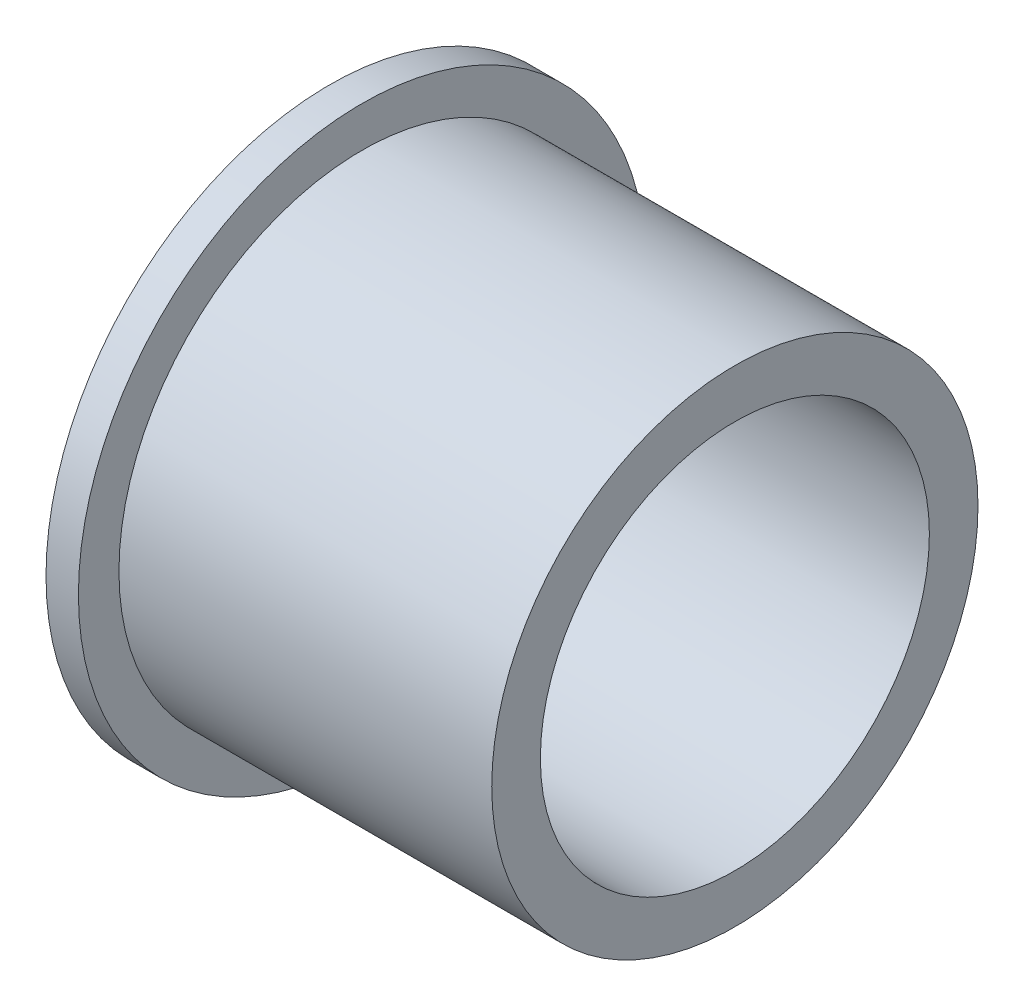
ISO-10303-21;
HEADER;
FILE_DESCRIPTION(('STEP AP214'),'2;1');
FILE_NAME('part.step','',(''),(''),'','','');
FILE_SCHEMA(('AUTOMOTIVE_DESIGN { 1 0 10303 214 1 1 1 1 }'));
ENDSEC;
DATA;
#1=APPLICATION_CONTEXT('core data for automotive mechanical design processes');
#2=APPLICATION_PROTOCOL_DEFINITION('international standard','automotive_design',2000,#1);
#3=PRODUCT_CONTEXT('',#1,'mechanical');
#4=PRODUCT('Part','Part','',(#3));
#5=PRODUCT_RELATED_PRODUCT_CATEGORY('part','',(#4));
#6=PRODUCT_DEFINITION_FORMATION('','',#4);
#7=PRODUCT_DEFINITION_CONTEXT('part definition',#1,'design');
#8=PRODUCT_DEFINITION('design','',#6,#7);
#9=PRODUCT_DEFINITION_SHAPE('','',#8);
#10=(LENGTH_UNIT() NAMED_UNIT(*) SI_UNIT(.MILLI.,.METRE.));
#11=(NAMED_UNIT(*) PLANE_ANGLE_UNIT() SI_UNIT($,.RADIAN.));
#12=(NAMED_UNIT(*) SI_UNIT($,.STERADIAN.) SOLID_ANGLE_UNIT());
#13=UNCERTAINTY_MEASURE_WITH_UNIT(LENGTH_MEASURE(1.E-05),#10,'distance_accuracy_value','');
#14=(GEOMETRIC_REPRESENTATION_CONTEXT(3) GLOBAL_UNCERTAINTY_ASSIGNED_CONTEXT((#13)) GLOBAL_UNIT_ASSIGNED_CONTEXT((#10,
#11,#12)) REPRESENTATION_CONTEXT('',''));
#15=CARTESIAN_POINT('',(0.,0.,0.));
#16=DIRECTION('',(0.,0.,1.));
#17=DIRECTION('',(1.,0.,0.));
#18=AXIS2_PLACEMENT_3D('',#15,#16,#17);
#19=CARTESIAN_POINT('',(-12.5,0.,0.));
#20=DIRECTION('',(-1.,0.,0.));
#21=DIRECTION('',(0.,0.,1.));
#22=AXIS2_PLACEMENT_3D('',#19,#20,#21);
#23=CYLINDRICAL_SURFACE('',#22,17.5);
#24=CARTESIAN_POINT('',(-12.5,0.,0.));
#25=DIRECTION('',(-1.,0.,0.));
#26=DIRECTION('',(0.,0.,1.));
#27=AXIS2_PLACEMENT_3D('',#24,#25,#26);
#28=CIRCLE('',#27,17.5);
#29=CARTESIAN_POINT('',(-12.5,0.,17.5));
#30=VERTEX_POINT('',#29);
#31=EDGE_CURVE('E50',#30,#30,#28,.T.);
#32=ORIENTED_EDGE('',*,*,#31,.F.);
#33=EDGE_LOOP('',(#32));
#34=FACE_BOUND('',#33,.T.);
#35=CARTESIAN_POINT('',(-10.5,0.,0.));
#36=DIRECTION('',(-1.,0.,0.));
#37=DIRECTION('',(0.,0.,1.));
#38=AXIS2_PLACEMENT_3D('',#35,#36,#37);
#39=CIRCLE('',#38,17.5);
#40=CARTESIAN_POINT('',(-10.5,0.,17.5));
#41=VERTEX_POINT('',#40);
#42=EDGE_CURVE('E10',#41,#41,#39,.T.);
#43=ORIENTED_EDGE('',*,*,#42,.T.);
#44=EDGE_LOOP('',(#43));
#45=FACE_BOUND('',#44,.T.);
#46=ADVANCED_FACE('F28',(#34,#45),#23,.T.);
#47=CARTESIAN_POINT('',(-10.5,17.5,0.));
#48=DIRECTION('',(-1.,0.,0.));
#49=DIRECTION('',(0.,0.,1.));
#50=AXIS2_PLACEMENT_3D('',#47,#48,#49);
#51=PLANE('',#50);
#52=ORIENTED_EDGE('',*,*,#42,.F.);
#53=EDGE_LOOP('',(#52));
#54=FACE_BOUND('',#53,.T.);
#55=CARTESIAN_POINT('',(-10.5,0.,0.));
#56=DIRECTION('',(-1.,0.,0.));
#57=DIRECTION('',(0.,0.,1.));
#58=AXIS2_PLACEMENT_3D('',#55,#56,#57);
#59=CIRCLE('',#58,15.);
#60=CARTESIAN_POINT('',(-10.5,0.,15.));
#61=VERTEX_POINT('',#60);
#62=EDGE_CURVE('E34',#61,#61,#59,.T.);
#63=ORIENTED_EDGE('',*,*,#62,.T.);
#64=EDGE_LOOP('',(#63));
#65=FACE_BOUND('',#64,.T.);
#66=ADVANCED_FACE('F57',(#54,#65),#51,.F.);
#67=CARTESIAN_POINT('',(-12.5,0.,0.));
#68=DIRECTION('',(-1.,0.,0.));
#69=DIRECTION('',(0.,0.,1.));
#70=AXIS2_PLACEMENT_3D('',#67,#68,#69);
#71=CYLINDRICAL_SURFACE('',#70,15.);
#72=ORIENTED_EDGE('',*,*,#62,.F.);
#73=EDGE_LOOP('',(#72));
#74=FACE_BOUND('',#73,.T.);
#75=CARTESIAN_POINT('',(12.5,0.,0.));
#76=DIRECTION('',(-1.,0.,0.));
#77=DIRECTION('',(0.,0.,1.));
#78=AXIS2_PLACEMENT_3D('',#75,#76,#77);
#79=CIRCLE('',#78,15.);
#80=CARTESIAN_POINT('',(12.5,0.,15.));
#81=VERTEX_POINT('',#80);
#82=EDGE_CURVE('E38',#81,#81,#79,.T.);
#83=ORIENTED_EDGE('',*,*,#82,.T.);
#84=EDGE_LOOP('',(#83));
#85=FACE_BOUND('',#84,.T.);
#86=ADVANCED_FACE('F61',(#74,#85),#71,.T.);
#87=CARTESIAN_POINT('',(12.5,15.,0.));
#88=DIRECTION('',(-1.,0.,0.));
#89=DIRECTION('',(0.,0.,1.));
#90=AXIS2_PLACEMENT_3D('',#87,#88,#89);
#91=PLANE('',#90);
#92=ORIENTED_EDGE('',*,*,#82,.F.);
#93=EDGE_LOOP('',(#92));
#94=FACE_BOUND('',#93,.T.);
#95=CARTESIAN_POINT('',(12.5,0.,0.));
#96=DIRECTION('',(-1.,0.,0.));
#97=DIRECTION('',(0.,0.,1.));
#98=AXIS2_PLACEMENT_3D('',#95,#96,#97);
#99=CIRCLE('',#98,12.);
#100=CARTESIAN_POINT('',(12.5,0.,12.));
#101=VERTEX_POINT('',#100);
#102=EDGE_CURVE('E42',#101,#101,#99,.T.);
#103=ORIENTED_EDGE('',*,*,#102,.T.);
#104=EDGE_LOOP('',(#103));
#105=FACE_BOUND('',#104,.T.);
#106=ADVANCED_FACE('F66',(#94,#105),#91,.F.);
#107=CARTESIAN_POINT('',(-12.5,0.,0.));
#108=DIRECTION('',(-1.,0.,0.));
#109=DIRECTION('',(0.,0.,1.));
#110=AXIS2_PLACEMENT_3D('',#107,#108,#109);
#111=CYLINDRICAL_SURFACE('',#110,12.);
#112=ORIENTED_EDGE('',*,*,#102,.F.);
#113=EDGE_LOOP('',(#112));
#114=FACE_BOUND('',#113,.T.);
#115=CARTESIAN_POINT('',(-12.5,0.,0.));
#116=DIRECTION('',(-1.,0.,0.));
#117=DIRECTION('',(0.,0.,1.));
#118=AXIS2_PLACEMENT_3D('',#115,#116,#117);
#119=CIRCLE('',#118,12.);
#120=CARTESIAN_POINT('',(-12.5,0.,12.));
#121=VERTEX_POINT('',#120);
#122=EDGE_CURVE('E47',#121,#121,#119,.T.);
#123=ORIENTED_EDGE('',*,*,#122,.T.);
#124=EDGE_LOOP('',(#123));
#125=FACE_BOUND('',#124,.T.);
#126=ADVANCED_FACE('F72',(#114,#125),#111,.F.);
#127=CARTESIAN_POINT('',(-12.5,12.,0.));
#128=DIRECTION('',(1.,0.,0.));
#129=DIRECTION('',(0.,0.,-1.));
#130=AXIS2_PLACEMENT_3D('',#127,#128,#129);
#131=PLANE('',#130);
#132=ORIENTED_EDGE('',*,*,#122,.F.);
#133=EDGE_LOOP('',(#132));
#134=FACE_BOUND('',#133,.T.);
#135=ORIENTED_EDGE('',*,*,#31,.T.);
#136=EDGE_LOOP('',(#135));
#137=FACE_BOUND('',#136,.T.);
#138=ADVANCED_FACE('F54',(#134,#137),#131,.F.);
#139=CLOSED_SHELL('',(#46,#66,#86,#106,#126,#138));
#140=MANIFOLD_SOLID_BREP('B2',#139);
#141=ADVANCED_BREP_SHAPE_REPRESENTATION('',(#18,#140),#14);
#142=SHAPE_DEFINITION_REPRESENTATION(#9,#141);
ENDSEC;
END-ISO-10303-21;
